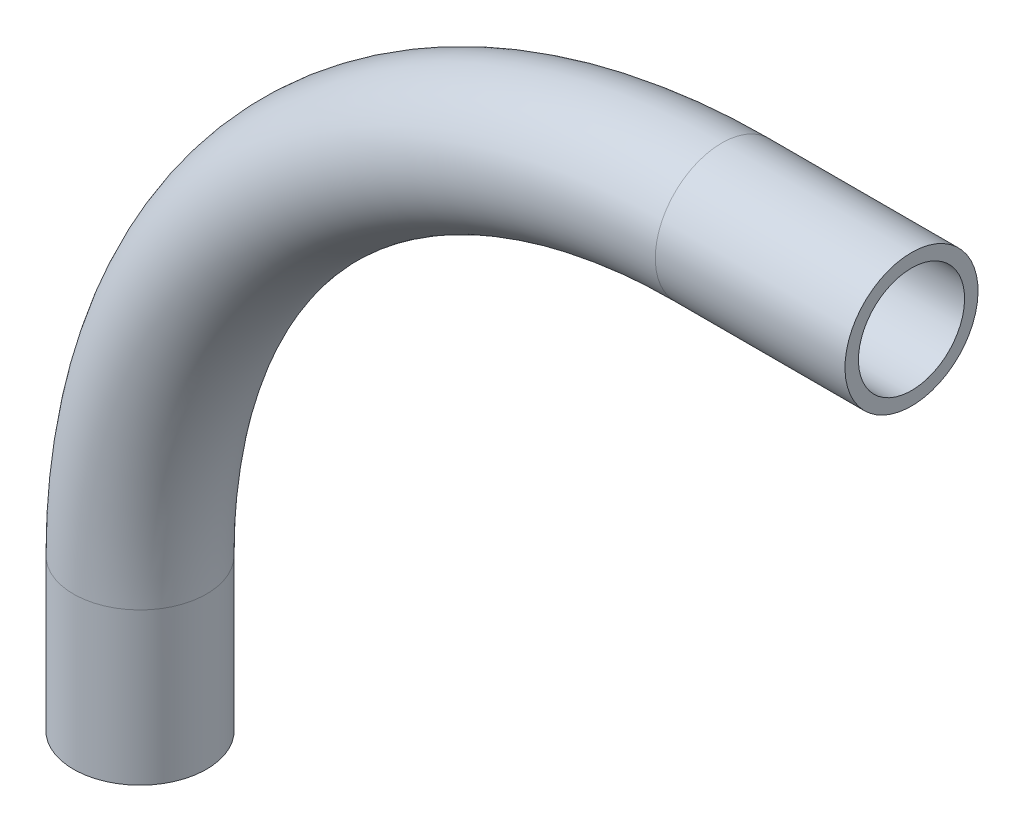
ISO-10303-21;
HEADER;
FILE_DESCRIPTION(('STEP AP214'),'2;1');
FILE_NAME('part.step','',(''),(''),'','','');
FILE_SCHEMA(('AUTOMOTIVE_DESIGN { 1 0 10303 214 1 1 1 1 }'));
ENDSEC;
DATA;
#1=APPLICATION_CONTEXT('core data for automotive mechanical design processes');
#2=APPLICATION_PROTOCOL_DEFINITION('international standard','automotive_design',2000,#1);
#3=PRODUCT_CONTEXT('',#1,'mechanical');
#4=PRODUCT('Part','Part','',(#3));
#5=PRODUCT_RELATED_PRODUCT_CATEGORY('part','',(#4));
#6=PRODUCT_DEFINITION_FORMATION('','',#4);
#7=PRODUCT_DEFINITION_CONTEXT('part definition',#1,'design');
#8=PRODUCT_DEFINITION('design','',#6,#7);
#9=PRODUCT_DEFINITION_SHAPE('','',#8);
#10=(LENGTH_UNIT() NAMED_UNIT(*) SI_UNIT(.MILLI.,.METRE.));
#11=(NAMED_UNIT(*) PLANE_ANGLE_UNIT() SI_UNIT($,.RADIAN.));
#12=(NAMED_UNIT(*) SI_UNIT($,.STERADIAN.) SOLID_ANGLE_UNIT());
#13=UNCERTAINTY_MEASURE_WITH_UNIT(LENGTH_MEASURE(1.E-05),#10,'distance_accuracy_value','');
#14=(GEOMETRIC_REPRESENTATION_CONTEXT(3) GLOBAL_UNCERTAINTY_ASSIGNED_CONTEXT((#13)) GLOBAL_UNIT_ASSIGNED_CONTEXT((#10,
#11,#12)) REPRESENTATION_CONTEXT('',''));
#15=CARTESIAN_POINT('',(0.,0.,0.));
#16=DIRECTION('',(0.,0.,1.));
#17=DIRECTION('',(1.,0.,0.));
#18=AXIS2_PLACEMENT_3D('',#15,#16,#17);
#19=CARTESIAN_POINT('',(0.,0.,0.));
#20=DIRECTION('',(0.,0.,1.));
#21=DIRECTION('',(1.,0.,0.));
#22=AXIS2_PLACEMENT_3D('',#19,#20,#21);
#23=TOROIDAL_SURFACE('',#22,146.05,16.7005);
#24=CARTESIAN_POINT('',(4.77501234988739E-13,146.05,0.));
#25=DIRECTION('',(1.,0.,0.));
#26=DIRECTION('',(0.,0.,1.));
#27=AXIS2_PLACEMENT_3D('',#24,#25,#26);
#28=CIRCLE('',#27,16.7005);
#29=CARTESIAN_POINT('',(5.32102463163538E-13,162.7505,0.));
#30=VERTEX_POINT('',#29);
#31=EDGE_CURVE('E10',#30,#30,#28,.T.);
#32=CARTESIAN_POINT('',(-146.05,0.,0.));
#33=DIRECTION('',(0.,-1.,0.));
#34=DIRECTION('',(0.,0.,-1.));
#35=AXIS2_PLACEMENT_3D('',#32,#33,#34);
#36=CIRCLE('',#35,16.7005);
#37=CARTESIAN_POINT('',(-162.7505,0.,0.));
#38=VERTEX_POINT('',#37);
#39=EDGE_CURVE('E59',#38,#38,#36,.T.);
#40=CARTESIAN_POINT('',(0.,0.,0.));
#41=DIRECTION('',(0.,0.,1.));
#42=DIRECTION('',(1.,0.,0.));
#43=AXIS2_PLACEMENT_3D('',#40,#41,#42);
#44=CIRCLE('',#43,162.7505);
#45=EDGE_CURVE('',#30,#38,#44,.T.);
#46=ORIENTED_EDGE('',*,*,#31,.F.);
#47=ORIENTED_EDGE('',*,*,#39,.F.);
#48=ORIENTED_EDGE('',*,*,#45,.T.);
#49=ORIENTED_EDGE('',*,*,#45,.F.);
#50=EDGE_LOOP('',(#46,#48,#47,#49));
#51=FACE_BOUND('',#50,.T.);
#52=ADVANCED_FACE('F34',(#51),#23,.T.);
#53=CARTESIAN_POINT('',(0.,0.,0.));
#54=DIRECTION('',(0.,0.,1.));
#55=DIRECTION('',(1.,0.,0.));
#56=AXIS2_PLACEMENT_3D('',#53,#54,#55);
#57=TOROIDAL_SURFACE('',#56,146.05,13.3223);
#58=CARTESIAN_POINT('',(4.77501234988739E-13,146.05,0.));
#59=DIRECTION('',(1.,0.,0.));
#60=DIRECTION('',(0.,1.,0.));
#61=AXIS2_PLACEMENT_3D('',#58,#59,#60);
#62=CIRCLE('',#61,13.3223);
#63=CARTESIAN_POINT('',(5.21057651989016E-13,159.3723,0.));
#64=VERTEX_POINT('',#63);
#65=EDGE_CURVE('E53',#64,#64,#62,.T.);
#66=CARTESIAN_POINT('',(-146.05,0.,0.));
#67=DIRECTION('',(0.,1.,0.));
#68=DIRECTION('',(0.,0.,1.));
#69=AXIS2_PLACEMENT_3D('',#66,#67,#68);
#70=CIRCLE('',#69,13.3223);
#71=CARTESIAN_POINT('',(-159.3723,0.,0.));
#72=VERTEX_POINT('',#71);
#73=EDGE_CURVE('E40',#72,#72,#70,.T.);
#74=CARTESIAN_POINT('',(0.,0.,0.));
#75=DIRECTION('',(0.,0.,1.));
#76=DIRECTION('',(1.,0.,0.));
#77=AXIS2_PLACEMENT_3D('',#74,#75,#76);
#78=CIRCLE('',#77,159.3723);
#79=EDGE_CURVE('',#64,#72,#78,.T.);
#80=ORIENTED_EDGE('',*,*,#65,.T.);
#81=ORIENTED_EDGE('',*,*,#73,.F.);
#82=ORIENTED_EDGE('',*,*,#79,.T.);
#83=ORIENTED_EDGE('',*,*,#79,.F.);
#84=EDGE_LOOP('',(#80,#82,#81,#83));
#85=FACE_BOUND('',#84,.T.);
#86=ADVANCED_FACE('F85',(#85),#57,.F.);
#87=CARTESIAN_POINT('',(47.6250000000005,146.05,0.));
#88=DIRECTION('',(1.,0.,0.));
#89=DIRECTION('',(0.,1.,0.));
#90=AXIS2_PLACEMENT_3D('',#87,#88,#89);
#91=PLANE('',#90);
#92=CARTESIAN_POINT('',(47.6250000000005,146.05,0.));
#93=DIRECTION('',(1.,0.,0.));
#94=DIRECTION('',(0.,1.,0.));
#95=AXIS2_PLACEMENT_3D('',#92,#93,#94);
#96=CIRCLE('',#95,16.7005);
#97=CARTESIAN_POINT('',(47.6250000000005,162.7505,0.));
#98=VERTEX_POINT('',#97);
#99=EDGE_CURVE('E44',#98,#98,#96,.T.);
#100=ORIENTED_EDGE('',*,*,#99,.T.);
#101=EDGE_LOOP('',(#100));
#102=FACE_BOUND('',#101,.T.);
#103=CARTESIAN_POINT('',(47.6250000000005,146.05,0.));
#104=DIRECTION('',(1.,0.,0.));
#105=DIRECTION('',(0.,1.,0.));
#106=AXIS2_PLACEMENT_3D('',#103,#104,#105);
#107=CIRCLE('',#106,13.3223);
#108=CARTESIAN_POINT('',(47.6250000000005,159.3723,0.));
#109=VERTEX_POINT('',#108);
#110=EDGE_CURVE('E48',#109,#109,#107,.T.);
#111=ORIENTED_EDGE('',*,*,#110,.F.);
#112=EDGE_LOOP('',(#111));
#113=FACE_BOUND('',#112,.T.);
#114=ADVANCED_FACE('F90',(#102,#113),#91,.T.);
#115=CARTESIAN_POINT('',(47.6250000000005,146.05,0.));
#116=DIRECTION('',(-1.,0.,0.));
#117=DIRECTION('',(0.,-1.,0.));
#118=AXIS2_PLACEMENT_3D('',#115,#116,#117);
#119=CYLINDRICAL_SURFACE('',#118,16.7005);
#120=ORIENTED_EDGE('',*,*,#99,.F.);
#121=EDGE_LOOP('',(#120));
#122=FACE_BOUND('',#121,.T.);
#123=ORIENTED_EDGE('',*,*,#31,.T.);
#124=EDGE_LOOP('',(#123));
#125=FACE_BOUND('',#124,.T.);
#126=ADVANCED_FACE('F80',(#122,#125),#119,.T.);
#127=CARTESIAN_POINT('',(47.6250000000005,146.05,0.));
#128=DIRECTION('',(-1.,0.,0.));
#129=DIRECTION('',(0.,-1.,0.));
#130=AXIS2_PLACEMENT_3D('',#127,#128,#129);
#131=CYLINDRICAL_SURFACE('',#130,13.3223);
#132=ORIENTED_EDGE('',*,*,#110,.T.);
#133=EDGE_LOOP('',(#132));
#134=FACE_BOUND('',#133,.T.);
#135=ORIENTED_EDGE('',*,*,#65,.F.);
#136=EDGE_LOOP('',(#135));
#137=FACE_BOUND('',#136,.T.);
#138=ADVANCED_FACE('F71',(#134,#137),#131,.F.);
#139=CARTESIAN_POINT('',(-146.05,-38.1,0.));
#140=DIRECTION('',(0.,-1.,0.));
#141=DIRECTION('',(0.,0.,-1.));
#142=AXIS2_PLACEMENT_3D('',#139,#140,#141);
#143=PLANE('',#142);
#144=CARTESIAN_POINT('',(-146.05,-38.1,0.));
#145=DIRECTION('',(0.,-1.,0.));
#146=DIRECTION('',(0.,0.,-1.));
#147=AXIS2_PLACEMENT_3D('',#144,#145,#146);
#148=CIRCLE('',#147,16.7005);
#149=CARTESIAN_POINT('',(-146.05,-38.1,-16.7005));
#150=VERTEX_POINT('',#149);
#151=EDGE_CURVE('E56',#150,#150,#148,.T.);
#152=ORIENTED_EDGE('',*,*,#151,.T.);
#153=EDGE_LOOP('',(#152));
#154=FACE_BOUND('',#153,.T.);
#155=CARTESIAN_POINT('',(-146.05,-38.1,0.));
#156=DIRECTION('',(0.,-1.,0.));
#157=DIRECTION('',(0.,0.,-1.));
#158=AXIS2_PLACEMENT_3D('',#155,#156,#157);
#159=CIRCLE('',#158,13.3223);
#160=CARTESIAN_POINT('',(-146.05,-38.1,-13.3223));
#161=VERTEX_POINT('',#160);
#162=EDGE_CURVE('E62',#161,#161,#159,.T.);
#163=ORIENTED_EDGE('',*,*,#162,.F.);
#164=EDGE_LOOP('',(#163));
#165=FACE_BOUND('',#164,.T.);
#166=ADVANCED_FACE('F68',(#154,#165),#143,.T.);
#167=CARTESIAN_POINT('',(-146.05,-38.1,0.));
#168=DIRECTION('',(0.,1.,0.));
#169=DIRECTION('',(0.,0.,1.));
#170=AXIS2_PLACEMENT_3D('',#167,#168,#169);
#171=CYLINDRICAL_SURFACE('',#170,16.7005);
#172=ORIENTED_EDGE('',*,*,#151,.F.);
#173=EDGE_LOOP('',(#172));
#174=FACE_BOUND('',#173,.T.);
#175=ORIENTED_EDGE('',*,*,#39,.T.);
#176=EDGE_LOOP('',(#175));
#177=FACE_BOUND('',#176,.T.);
#178=ADVANCED_FACE('F70',(#174,#177),#171,.T.);
#179=CARTESIAN_POINT('',(-146.05,-38.1,0.));
#180=DIRECTION('',(0.,1.,0.));
#181=DIRECTION('',(0.,0.,1.));
#182=AXIS2_PLACEMENT_3D('',#179,#180,#181);
#183=CYLINDRICAL_SURFACE('',#182,13.3223);
#184=ORIENTED_EDGE('',*,*,#162,.T.);
#185=EDGE_LOOP('',(#184));
#186=FACE_BOUND('',#185,.T.);
#187=ORIENTED_EDGE('',*,*,#73,.T.);
#188=EDGE_LOOP('',(#187));
#189=FACE_BOUND('',#188,.T.);
#190=ADVANCED_FACE('F66',(#186,#189),#183,.F.);
#191=CLOSED_SHELL('',(#52,#86,#114,#126,#138,#166,#178,#190));
#192=MANIFOLD_SOLID_BREP('B2',#191);
#193=ADVANCED_BREP_SHAPE_REPRESENTATION('',(#18,#192),#14);
#194=SHAPE_DEFINITION_REPRESENTATION(#9,#193);
ENDSEC;
END-ISO-10303-21;
